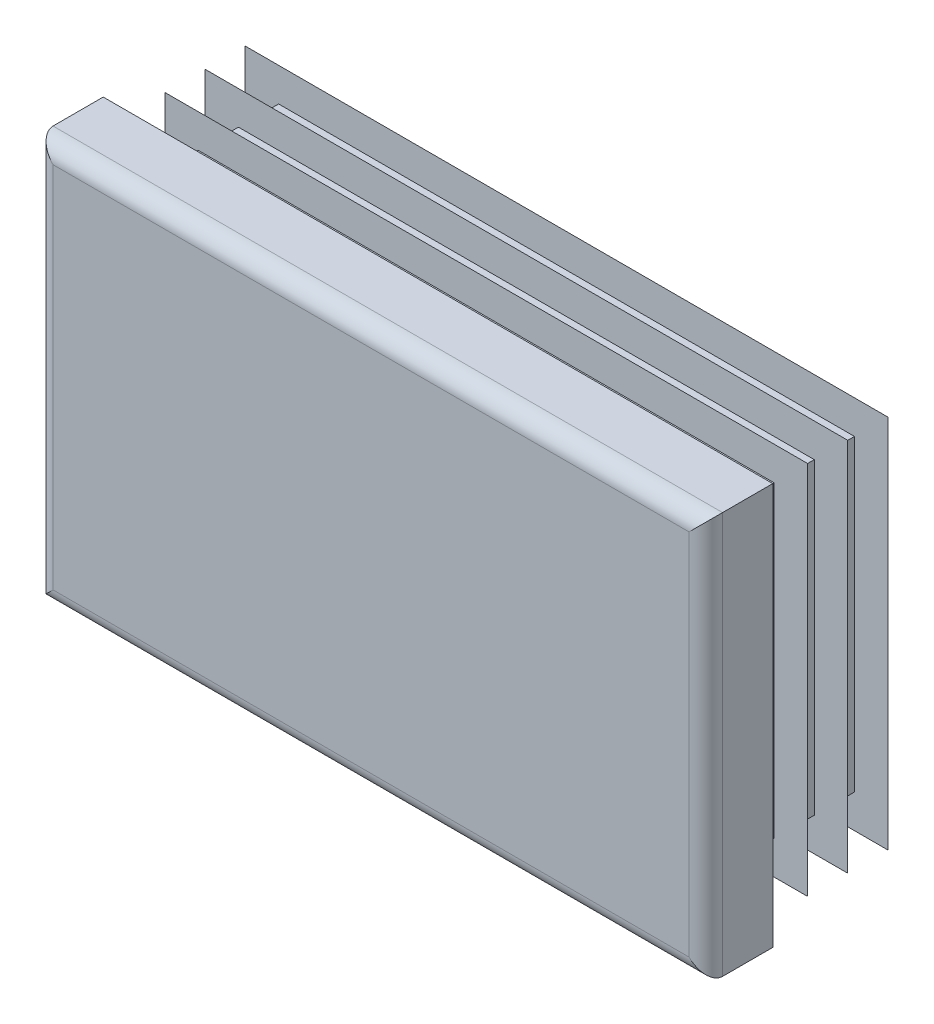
ISO-10303-21;
HEADER;
FILE_DESCRIPTION(('STEP AP214'),'2;1');
FILE_NAME('part.step','',(''),(''),'','','');
FILE_SCHEMA(('AUTOMOTIVE_DESIGN { 1 0 10303 214 1 1 1 1 }'));
ENDSEC;
DATA;
#1=APPLICATION_CONTEXT('core data for automotive mechanical design processes');
#2=APPLICATION_PROTOCOL_DEFINITION('international standard','automotive_design',2000,#1);
#3=PRODUCT_CONTEXT('',#1,'mechanical');
#4=PRODUCT('Part','Part','',(#3));
#5=PRODUCT_RELATED_PRODUCT_CATEGORY('part','',(#4));
#6=PRODUCT_DEFINITION_FORMATION('','',#4);
#7=PRODUCT_DEFINITION_CONTEXT('part definition',#1,'design');
#8=PRODUCT_DEFINITION('design','',#6,#7);
#9=PRODUCT_DEFINITION_SHAPE('','',#8);
#10=(LENGTH_UNIT() NAMED_UNIT(*) SI_UNIT(.MILLI.,.METRE.));
#11=(NAMED_UNIT(*) PLANE_ANGLE_UNIT() SI_UNIT($,.RADIAN.));
#12=(NAMED_UNIT(*) SI_UNIT($,.STERADIAN.) SOLID_ANGLE_UNIT());
#13=UNCERTAINTY_MEASURE_WITH_UNIT(LENGTH_MEASURE(1.E-05),#10,'distance_accuracy_value','');
#14=(GEOMETRIC_REPRESENTATION_CONTEXT(3) GLOBAL_UNCERTAINTY_ASSIGNED_CONTEXT((#13)) GLOBAL_UNIT_ASSIGNED_CONTEXT((#10,
#11,#12)) REPRESENTATION_CONTEXT('',''));
#15=CARTESIAN_POINT('',(0.,0.,0.));
#16=DIRECTION('',(0.,0.,1.));
#17=DIRECTION('',(1.,0.,0.));
#18=AXIS2_PLACEMENT_3D('',#15,#16,#17);
#19=CARTESIAN_POINT('',(23.75,-15.,5.));
#20=DIRECTION('',(0.,0.,-1.));
#21=DIRECTION('',(0.,1.,0.));
#22=AXIS2_PLACEMENT_3D('',#19,#20,#21);
#23=PLANE('',#22);
#24=DIRECTION('',(0.,1.,0.));
#25=VECTOR('',#24,1.);
#26=CARTESIAN_POINT('',(-23.75,-15.,5.));
#27=LINE('',#26,#25);
#28=CARTESIAN_POINT('',(-23.75,-13.75,5.));
#29=VERTEX_POINT('',#28);
#30=CARTESIAN_POINT('',(-23.75,13.75,5.));
#31=VERTEX_POINT('',#30);
#32=EDGE_CURVE('E310',#29,#31,#27,.T.);
#33=ORIENTED_EDGE('',*,*,#32,.F.);
#34=DIRECTION('',(-1.,0.,0.));
#35=VECTOR('',#34,1.);
#36=CARTESIAN_POINT('',(25.,-13.75,5.));
#37=LINE('',#36,#35);
#38=CARTESIAN_POINT('',(23.75,-13.75,5.));
#39=VERTEX_POINT('',#38);
#40=EDGE_CURVE('E482',#39,#29,#37,.T.);
#41=ORIENTED_EDGE('',*,*,#40,.F.);
#42=DIRECTION('',(0.,1.,0.));
#43=VECTOR('',#42,1.);
#44=CARTESIAN_POINT('',(23.75,-15.,5.));
#45=LINE('',#44,#43);
#46=CARTESIAN_POINT('',(23.75,13.75,5.));
#47=VERTEX_POINT('',#46);
#48=EDGE_CURVE('E305',#39,#47,#45,.T.);
#49=ORIENTED_EDGE('',*,*,#48,.T.);
#50=DIRECTION('',(-1.,0.,0.));
#51=VECTOR('',#50,1.);
#52=CARTESIAN_POINT('',(25.,13.75,5.));
#53=LINE('',#52,#51);
#54=EDGE_CURVE('E630',#47,#31,#53,.T.);
#55=ORIENTED_EDGE('',*,*,#54,.T.);
#56=EDGE_LOOP('',(#33,#41,#49,#55));
#57=FACE_BOUND('',#56,.T.);
#58=ADVANCED_FACE('F14',(#57),#23,.F.);
#59=CARTESIAN_POINT('',(-23.75,-15.,3.75));
#60=DIRECTION('',(0.,1.,0.));
#61=DIRECTION('',(-1.,0.,0.));
#62=AXIS2_PLACEMENT_3D('',#59,#60,#61);
#63=CYLINDRICAL_SURFACE('',#62,1.25);
#64=DIRECTION('',(0.,1.,0.));
#65=VECTOR('',#64,1.);
#66=CARTESIAN_POINT('',(-25.,-15.,3.75));
#67=LINE('',#66,#65);
#68=CARTESIAN_POINT('',(-25.,-15.,3.75));
#69=VERTEX_POINT('',#68);
#70=CARTESIAN_POINT('',(-25.,15.,3.75));
#71=VERTEX_POINT('',#70);
#72=EDGE_CURVE('E402',#69,#71,#67,.T.);
#73=ORIENTED_EDGE('',*,*,#72,.F.);
#74=CARTESIAN_POINT('',(-23.75,-13.75,3.75));
#75=DIRECTION('',(-0.707106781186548,0.707106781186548,0.));
#76=DIRECTION('',(0.707106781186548,0.707106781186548,0.));
#77=AXIS2_PLACEMENT_3D('',#74,#75,#76);
#78=ELLIPSE('',#77,1.76776695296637,1.25);
#79=EDGE_CURVE('E59',#69,#29,#78,.T.);
#80=ORIENTED_EDGE('',*,*,#79,.T.);
#81=ORIENTED_EDGE('',*,*,#32,.T.);
#82=CARTESIAN_POINT('',(-23.75,13.75,3.75));
#83=DIRECTION('',(0.707106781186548,0.707106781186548,0.));
#84=DIRECTION('',(-0.707106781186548,0.707106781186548,0.));
#85=AXIS2_PLACEMENT_3D('',#82,#83,#84);
#86=ELLIPSE('',#85,1.76776695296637,1.25);
#87=EDGE_CURVE('E306',#31,#71,#86,.F.);
#88=ORIENTED_EDGE('',*,*,#87,.T.);
#89=EDGE_LOOP('',(#73,#80,#81,#88));
#90=FACE_BOUND('',#89,.T.);
#91=ADVANCED_FACE('F16',(#90),#63,.T.);
#92=CARTESIAN_POINT('',(-25.,-15.,3.75));
#93=DIRECTION('',(1.,0.,0.));
#94=DIRECTION('',(0.,1.,0.));
#95=AXIS2_PLACEMENT_3D('',#92,#93,#94);
#96=PLANE('',#95);
#97=DIRECTION('',(0.,0.,-1.));
#98=VECTOR('',#97,1.);
#99=CARTESIAN_POINT('',(-25.,15.,3.75));
#100=LINE('',#99,#98);
#101=CARTESIAN_POINT('',(-25.,15.,0.));
#102=VERTEX_POINT('',#101);
#103=EDGE_CURVE('E615',#71,#102,#100,.T.);
#104=ORIENTED_EDGE('',*,*,#103,.T.);
#105=DIRECTION('',(0.,1.,0.));
#106=VECTOR('',#105,1.);
#107=CARTESIAN_POINT('',(-25.,-15.,0.));
#108=LINE('',#107,#106);
#109=CARTESIAN_POINT('',(-25.,-15.,0.));
#110=VERTEX_POINT('',#109);
#111=EDGE_CURVE('E400',#110,#102,#108,.T.);
#112=ORIENTED_EDGE('',*,*,#111,.F.);
#113=DIRECTION('',(0.,0.,-1.));
#114=VECTOR('',#113,1.);
#115=CARTESIAN_POINT('',(-25.,-15.,3.75));
#116=LINE('',#115,#114);
#117=EDGE_CURVE('E616',#69,#110,#116,.T.);
#118=ORIENTED_EDGE('',*,*,#117,.F.);
#119=ORIENTED_EDGE('',*,*,#72,.T.);
#120=EDGE_LOOP('',(#104,#112,#118,#119));
#121=FACE_BOUND('',#120,.T.);
#122=ADVANCED_FACE('F697',(#121),#96,.F.);
#123=CARTESIAN_POINT('',(-21.5,-15.,0.));
#124=DIRECTION('',(1.,0.,0.));
#125=DIRECTION('',(0.,1.,0.));
#126=AXIS2_PLACEMENT_3D('',#123,#124,#125);
#127=PLANE('',#126);
#128=DIRECTION('',(0.,1.,0.));
#129=VECTOR('',#128,1.);
#130=CARTESIAN_POINT('',(-21.5,-15.,0.));
#131=LINE('',#130,#129);
#132=CARTESIAN_POINT('',(-21.5,-11.5,0.));
#133=VERTEX_POINT('',#132);
#134=CARTESIAN_POINT('',(-21.5,11.5,0.));
#135=VERTEX_POINT('',#134);
#136=EDGE_CURVE('E397',#133,#135,#131,.T.);
#137=ORIENTED_EDGE('',*,*,#136,.T.);
#138=DIRECTION('',(0.,0.,-1.));
#139=VECTOR('',#138,1.);
#140=CARTESIAN_POINT('',(-21.5,11.5,0.));
#141=LINE('',#140,#139);
#142=CARTESIAN_POINT('',(-21.5,11.5,-0.6));
#143=VERTEX_POINT('',#142);
#144=EDGE_CURVE('E495',#135,#143,#141,.T.);
#145=ORIENTED_EDGE('',*,*,#144,.T.);
#146=DIRECTION('',(0.,1.,0.));
#147=VECTOR('',#146,1.);
#148=CARTESIAN_POINT('',(-21.5,-15.,-0.6));
#149=LINE('',#148,#147);
#150=CARTESIAN_POINT('',(-21.5,-11.5,-0.6));
#151=VERTEX_POINT('',#150);
#152=EDGE_CURVE('E394',#151,#143,#149,.T.);
#153=ORIENTED_EDGE('',*,*,#152,.F.);
#154=DIRECTION('',(0.,0.,1.));
#155=VECTOR('',#154,1.);
#156=CARTESIAN_POINT('',(-21.5,-11.5,0.));
#157=LINE('',#156,#155);
#158=EDGE_CURVE('E489',#151,#133,#157,.T.);
#159=ORIENTED_EDGE('',*,*,#158,.T.);
#160=EDGE_LOOP('',(#137,#145,#153,#159));
#161=FACE_BOUND('',#160,.T.);
#162=ADVANCED_FACE('F787',(#161),#127,.F.);
#163=CARTESIAN_POINT('',(-24.,-15.,-0.6));
#164=DIRECTION('',(0.342020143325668,0.,0.939692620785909));
#165=DIRECTION('',(-0.939692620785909,0.,0.342020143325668));
#166=AXIS2_PLACEMENT_3D('',#163,#164,#165);
#167=PLANE('',#166);
#168=DIRECTION('',(0.,1.,0.));
#169=VECTOR('',#168,1.);
#170=CARTESIAN_POINT('',(-24.,-15.,-0.6));
#171=LINE('',#170,#169);
#172=CARTESIAN_POINT('',(-24.,-14.,-0.6));
#173=VERTEX_POINT('',#172);
#174=CARTESIAN_POINT('',(-24.,14.,-0.6));
#175=VERTEX_POINT('',#174);
#176=EDGE_CURVE('E392',#173,#175,#171,.T.);
#177=ORIENTED_EDGE('',*,*,#176,.T.);
#178=DIRECTION('',(0.844349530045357,-0.43889572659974,-0.307318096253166));
#179=VECTOR('',#178,1.);
#180=CARTESIAN_POINT('',(-13.2531393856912,8.41374569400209,-4.51153737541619));
#181=LINE('',#180,#179);
#182=CARTESIAN_POINT('',(-21.5,12.7004915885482,-1.5099255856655));
#183=VERTEX_POINT('',#182);
#184=EDGE_CURVE('E519',#175,#183,#181,.T.);
#185=ORIENTED_EDGE('',*,*,#184,.T.);
#186=DIRECTION('',(0.,1.,0.));
#187=VECTOR('',#186,1.);
#188=CARTESIAN_POINT('',(-21.5,-15.,-1.5099255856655));
#189=LINE('',#188,#187);
#190=CARTESIAN_POINT('',(-21.5,-12.7004915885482,-1.5099255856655));
#191=VERTEX_POINT('',#190);
#192=EDGE_CURVE('E389',#191,#183,#189,.T.);
#193=ORIENTED_EDGE('',*,*,#192,.F.);
#194=DIRECTION('',(-0.844349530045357,-0.43889572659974,0.307318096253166));
#195=VECTOR('',#194,1.);
#196=CARTESIAN_POINT('',(-24.3705814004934,-14.1926294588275,-0.465119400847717));
#197=LINE('',#196,#195);
#198=EDGE_CURVE('E507',#191,#173,#197,.T.);
#199=ORIENTED_EDGE('',*,*,#198,.T.);
#200=EDGE_LOOP('',(#177,#185,#193,#199));
#201=FACE_BOUND('',#200,.T.);
#202=ADVANCED_FACE('F783',(#201),#167,.F.);
#203=CARTESIAN_POINT('',(-21.5,-15.,-1.5099255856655));
#204=DIRECTION('',(1.,0.,0.));
#205=DIRECTION('',(0.,1.,0.));
#206=AXIS2_PLACEMENT_3D('',#203,#204,#205);
#207=PLANE('',#206);
#208=ORIENTED_EDGE('',*,*,#192,.T.);
#209=DIRECTION('',(0.,-0.819152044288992,-0.573576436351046));
#210=VECTOR('',#209,1.);
#211=CARTESIAN_POINT('',(-21.5,-5.88681725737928,-14.5248993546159));
#212=LINE('',#211,#210);
#213=CARTESIAN_POINT('',(-21.5,11.5,-2.35051884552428));
#214=VERTEX_POINT('',#213);
#215=EDGE_CURVE('E516',#183,#214,#212,.T.);
#216=ORIENTED_EDGE('',*,*,#215,.T.);
#217=DIRECTION('',(0.,0.,-1.));
#218=VECTOR('',#217,1.);
#219=CARTESIAN_POINT('',(-21.5,11.5,-1.5099255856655));
#220=LINE('',#219,#218);
#221=CARTESIAN_POINT('',(-21.5,11.5,-3.6));
#222=VERTEX_POINT('',#221);
#223=EDGE_CURVE('E525',#214,#222,#220,.T.);
#224=ORIENTED_EDGE('',*,*,#223,.T.);
#225=DIRECTION('',(0.,1.,0.));
#226=VECTOR('',#225,1.);
#227=CARTESIAN_POINT('',(-21.5,-15.,-3.6));
#228=LINE('',#227,#226);
#229=CARTESIAN_POINT('',(-21.5,-11.5,-3.6));
#230=VERTEX_POINT('',#229);
#231=EDGE_CURVE('E386',#230,#222,#228,.T.);
#232=ORIENTED_EDGE('',*,*,#231,.F.);
#233=DIRECTION('',(0.,0.,1.));
#234=VECTOR('',#233,1.);
#235=CARTESIAN_POINT('',(-21.5,-11.5,-1.5099255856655));
#236=LINE('',#235,#234);
#237=CARTESIAN_POINT('',(-21.5,-11.5,-2.35051884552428));
#238=VERTEX_POINT('',#237);
#239=EDGE_CURVE('E522',#230,#238,#236,.T.);
#240=ORIENTED_EDGE('',*,*,#239,.T.);
#241=DIRECTION('',(0.,-0.819152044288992,0.573576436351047));
#242=VECTOR('',#241,1.);
#243=CARTESIAN_POINT('',(-21.5,-14.2434848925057,-0.429510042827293));
#244=LINE('',#243,#242);
#245=EDGE_CURVE('E504',#238,#191,#244,.T.);
#246=ORIENTED_EDGE('',*,*,#245,.T.);
#247=EDGE_LOOP('',(#208,#216,#224,#232,#240,#246));
#248=FACE_BOUND('',#247,.T.);
#249=ADVANCED_FACE('F779',(#248),#207,.F.);
#250=CARTESIAN_POINT('',(-24.,-15.,-3.6));
#251=DIRECTION('',(0.34202014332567,0.,0.939692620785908));
#252=DIRECTION('',(-0.939692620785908,0.,0.34202014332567));
#253=AXIS2_PLACEMENT_3D('',#250,#251,#252);
#254=PLANE('',#253);
#255=DIRECTION('',(0.,1.,0.));
#256=VECTOR('',#255,1.);
#257=CARTESIAN_POINT('',(-24.,-15.,-3.6));
#258=LINE('',#257,#256);
#259=CARTESIAN_POINT('',(-24.,-14.,-3.6));
#260=VERTEX_POINT('',#259);
#261=CARTESIAN_POINT('',(-24.,14.,-3.6));
#262=VERTEX_POINT('',#261);
#263=EDGE_CURVE('E384',#260,#262,#258,.T.);
#264=ORIENTED_EDGE('',*,*,#263,.T.);
#265=DIRECTION('',(0.844349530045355,-0.438895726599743,-0.307318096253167));
#266=VECTOR('',#265,1.);
#267=CARTESIAN_POINT('',(-13.2531393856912,8.41374569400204,-7.51153737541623));
#268=LINE('',#267,#266);
#269=CARTESIAN_POINT('',(-21.5,12.7004915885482,-4.50992558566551));
#270=VERTEX_POINT('',#269);
#271=EDGE_CURVE('E549',#262,#270,#268,.T.);
#272=ORIENTED_EDGE('',*,*,#271,.T.);
#273=DIRECTION('',(0.,1.,0.));
#274=VECTOR('',#273,1.);
#275=CARTESIAN_POINT('',(-21.5,-15.,-4.50992558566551));
#276=LINE('',#275,#274);
#277=CARTESIAN_POINT('',(-21.5,-12.7004915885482,-4.50992558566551));
#278=VERTEX_POINT('',#277);
#279=EDGE_CURVE('E381',#278,#270,#276,.T.);
#280=ORIENTED_EDGE('',*,*,#279,.F.);
#281=DIRECTION('',(-0.844349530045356,-0.438895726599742,0.307318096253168));
#282=VECTOR('',#281,1.);
#283=CARTESIAN_POINT('',(-24.3705814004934,-14.1926294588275,-3.46511940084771));
#284=LINE('',#283,#282);
#285=EDGE_CURVE('E537',#278,#260,#284,.T.);
#286=ORIENTED_EDGE('',*,*,#285,.T.);
#287=EDGE_LOOP('',(#264,#272,#280,#286));
#288=FACE_BOUND('',#287,.T.);
#289=ADVANCED_FACE('F775',(#288),#254,.F.);
#290=CARTESIAN_POINT('',(-21.5,-15.,-4.50992558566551));
#291=DIRECTION('',(1.,0.,0.));
#292=DIRECTION('',(0.,1.,0.));
#293=AXIS2_PLACEMENT_3D('',#290,#291,#292);
#294=PLANE('',#293);
#295=ORIENTED_EDGE('',*,*,#279,.T.);
#296=DIRECTION('',(0.,-0.819152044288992,-0.573576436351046));
#297=VECTOR('',#296,1.);
#298=CARTESIAN_POINT('',(-21.5,-5.88681725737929,-17.5248993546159));
#299=LINE('',#298,#297);
#300=CARTESIAN_POINT('',(-21.5,11.5,-5.35051884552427));
#301=VERTEX_POINT('',#300);
#302=EDGE_CURVE('E546',#270,#301,#299,.T.);
#303=ORIENTED_EDGE('',*,*,#302,.T.);
#304=DIRECTION('',(0.,0.,-1.));
#305=VECTOR('',#304,1.);
#306=CARTESIAN_POINT('',(-21.5,11.5,-4.50992558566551));
#307=LINE('',#306,#305);
#308=CARTESIAN_POINT('',(-21.5,11.5,-6.6));
#309=VERTEX_POINT('',#308);
#310=EDGE_CURVE('E555',#301,#309,#307,.T.);
#311=ORIENTED_EDGE('',*,*,#310,.T.);
#312=DIRECTION('',(0.,1.,0.));
#313=VECTOR('',#312,1.);
#314=CARTESIAN_POINT('',(-21.5,-15.,-6.6));
#315=LINE('',#314,#313);
#316=CARTESIAN_POINT('',(-21.5,-11.5,-6.6));
#317=VERTEX_POINT('',#316);
#318=EDGE_CURVE('E378',#317,#309,#315,.T.);
#319=ORIENTED_EDGE('',*,*,#318,.F.);
#320=DIRECTION('',(0.,0.,1.));
#321=VECTOR('',#320,1.);
#322=CARTESIAN_POINT('',(-21.5,-11.5,-4.50992558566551));
#323=LINE('',#322,#321);
#324=CARTESIAN_POINT('',(-21.5,-11.5,-5.35051884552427));
#325=VERTEX_POINT('',#324);
#326=EDGE_CURVE('E552',#317,#325,#323,.T.);
#327=ORIENTED_EDGE('',*,*,#326,.T.);
#328=DIRECTION('',(0.,-0.819152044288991,0.573576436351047));
#329=VECTOR('',#328,1.);
#330=CARTESIAN_POINT('',(-21.5,-14.2434848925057,-3.42951004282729));
#331=LINE('',#330,#329);
#332=EDGE_CURVE('E534',#325,#278,#331,.T.);
#333=ORIENTED_EDGE('',*,*,#332,.T.);
#334=EDGE_LOOP('',(#295,#303,#311,#319,#327,#333));
#335=FACE_BOUND('',#334,.T.);
#336=ADVANCED_FACE('F771',(#335),#294,.F.);
#337=CARTESIAN_POINT('',(-24.,-15.,-6.6));
#338=DIRECTION('',(0.34202014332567,0.,0.939692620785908));
#339=DIRECTION('',(-0.939692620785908,0.,0.34202014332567));
#340=AXIS2_PLACEMENT_3D('',#337,#338,#339);
#341=PLANE('',#340);
#342=DIRECTION('',(0.,1.,0.));
#343=VECTOR('',#342,1.);
#344=CARTESIAN_POINT('',(-24.,-15.,-6.6));
#345=LINE('',#344,#343);
#346=CARTESIAN_POINT('',(-24.,-14.,-6.6));
#347=VERTEX_POINT('',#346);
#348=CARTESIAN_POINT('',(-24.,14.,-6.6));
#349=VERTEX_POINT('',#348);
#350=EDGE_CURVE('E376',#347,#349,#345,.T.);
#351=ORIENTED_EDGE('',*,*,#350,.T.);
#352=DIRECTION('',(0.844349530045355,-0.438895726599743,-0.307318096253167));
#353=VECTOR('',#352,1.);
#354=CARTESIAN_POINT('',(-13.2531393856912,8.41374569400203,-10.5115373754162));
#355=LINE('',#354,#353);
#356=CARTESIAN_POINT('',(-21.5,12.7004915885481,-7.50992558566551));
#357=VERTEX_POINT('',#356);
#358=EDGE_CURVE('E579',#349,#357,#355,.T.);
#359=ORIENTED_EDGE('',*,*,#358,.T.);
#360=DIRECTION('',(0.,1.,0.));
#361=VECTOR('',#360,1.);
#362=CARTESIAN_POINT('',(-21.5,-15.,-7.50992558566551));
#363=LINE('',#362,#361);
#364=CARTESIAN_POINT('',(-21.5,-12.7004915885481,-7.50992558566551));
#365=VERTEX_POINT('',#364);
#366=EDGE_CURVE('E373',#365,#357,#363,.T.);
#367=ORIENTED_EDGE('',*,*,#366,.F.);
#368=DIRECTION('',(-0.844349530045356,-0.438895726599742,0.307318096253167));
#369=VECTOR('',#368,1.);
#370=CARTESIAN_POINT('',(-24.3705814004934,-14.1926294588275,-6.46511940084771));
#371=LINE('',#370,#369);
#372=EDGE_CURVE('E567',#365,#347,#371,.T.);
#373=ORIENTED_EDGE('',*,*,#372,.T.);
#374=EDGE_LOOP('',(#351,#359,#367,#373));
#375=FACE_BOUND('',#374,.T.);
#376=ADVANCED_FACE('F767',(#375),#341,.F.);
#377=CARTESIAN_POINT('',(-21.5,-15.,-7.50992558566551));
#378=DIRECTION('',(1.,0.,0.));
#379=DIRECTION('',(0.,1.,0.));
#380=AXIS2_PLACEMENT_3D('',#377,#378,#379);
#381=PLANE('',#380);
#382=ORIENTED_EDGE('',*,*,#366,.T.);
#383=DIRECTION('',(0.,-0.819152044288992,-0.573576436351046));
#384=VECTOR('',#383,1.);
#385=CARTESIAN_POINT('',(-21.5,-5.8868172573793,-20.5248993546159));
#386=LINE('',#385,#384);
#387=CARTESIAN_POINT('',(-21.5,11.5,-8.35051884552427));
#388=VERTEX_POINT('',#387);
#389=EDGE_CURVE('E576',#357,#388,#386,.T.);
#390=ORIENTED_EDGE('',*,*,#389,.T.);
#391=DIRECTION('',(0.,0.,-1.));
#392=VECTOR('',#391,1.);
#393=CARTESIAN_POINT('',(-21.5,11.5,-7.50992558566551));
#394=LINE('',#393,#392);
#395=CARTESIAN_POINT('',(-21.5,11.5,-9.6));
#396=VERTEX_POINT('',#395);
#397=EDGE_CURVE('E585',#388,#396,#394,.T.);
#398=ORIENTED_EDGE('',*,*,#397,.T.);
#399=DIRECTION('',(0.,1.,0.));
#400=VECTOR('',#399,1.);
#401=CARTESIAN_POINT('',(-21.5,-15.,-9.6));
#402=LINE('',#401,#400);
#403=CARTESIAN_POINT('',(-21.5,-11.5,-9.6));
#404=VERTEX_POINT('',#403);
#405=EDGE_CURVE('E370',#404,#396,#402,.T.);
#406=ORIENTED_EDGE('',*,*,#405,.F.);
#407=DIRECTION('',(0.,0.,1.));
#408=VECTOR('',#407,1.);
#409=CARTESIAN_POINT('',(-21.5,-11.5,-7.50992558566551));
#410=LINE('',#409,#408);
#411=CARTESIAN_POINT('',(-21.5,-11.5,-8.35051884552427));
#412=VERTEX_POINT('',#411);
#413=EDGE_CURVE('E582',#404,#412,#410,.T.);
#414=ORIENTED_EDGE('',*,*,#413,.T.);
#415=DIRECTION('',(0.,-0.819152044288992,0.573576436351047));
#416=VECTOR('',#415,1.);
#417=CARTESIAN_POINT('',(-21.5,-14.2434848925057,-6.42951004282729));
#418=LINE('',#417,#416);
#419=EDGE_CURVE('E564',#412,#365,#418,.T.);
#420=ORIENTED_EDGE('',*,*,#419,.T.);
#421=EDGE_LOOP('',(#382,#390,#398,#406,#414,#420));
#422=FACE_BOUND('',#421,.T.);
#423=ADVANCED_FACE('F764',(#422),#381,.F.);
#424=CARTESIAN_POINT('',(-24.,-15.,-9.6));
#425=DIRECTION('',(0.342020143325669,0.,0.939692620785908));
#426=DIRECTION('',(-0.939692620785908,0.,0.342020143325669));
#427=AXIS2_PLACEMENT_3D('',#424,#425,#426);
#428=PLANE('',#427);
#429=DIRECTION('',(0.,1.,0.));
#430=VECTOR('',#429,1.);
#431=CARTESIAN_POINT('',(-24.,-15.,-9.6));
#432=LINE('',#431,#430);
#433=CARTESIAN_POINT('',(-24.,-14.,-9.6));
#434=VERTEX_POINT('',#433);
#435=CARTESIAN_POINT('',(-24.,14.,-9.6));
#436=VERTEX_POINT('',#435);
#437=EDGE_CURVE('E368',#434,#436,#432,.T.);
#438=ORIENTED_EDGE('',*,*,#437,.T.);
#439=DIRECTION('',(0.844349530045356,-0.438895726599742,-0.307318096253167));
#440=VECTOR('',#439,1.);
#441=CARTESIAN_POINT('',(-13.2531393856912,8.41374569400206,-13.5115373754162));
#442=LINE('',#441,#440);
#443=CARTESIAN_POINT('',(-21.5,12.7004915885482,-10.5099255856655));
#444=VERTEX_POINT('',#443);
#445=EDGE_CURVE('E607',#436,#444,#442,.T.);
#446=ORIENTED_EDGE('',*,*,#445,.T.);
#447=DIRECTION('',(0.,1.,0.));
#448=VECTOR('',#447,1.);
#449=CARTESIAN_POINT('',(-21.5,-15.,-10.5099255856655));
#450=LINE('',#449,#448);
#451=CARTESIAN_POINT('',(-21.5,-12.7004915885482,-10.5099255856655));
#452=VERTEX_POINT('',#451);
#453=EDGE_CURVE('E365',#452,#444,#450,.T.);
#454=ORIENTED_EDGE('',*,*,#453,.F.);
#455=DIRECTION('',(-0.844349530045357,-0.438895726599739,0.307318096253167));
#456=VECTOR('',#455,1.);
#457=CARTESIAN_POINT('',(-24.3705814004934,-14.1926294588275,-9.46511940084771));
#458=LINE('',#457,#456);
#459=EDGE_CURVE('E595',#452,#434,#458,.T.);
#460=ORIENTED_EDGE('',*,*,#459,.T.);
#461=EDGE_LOOP('',(#438,#446,#454,#460));
#462=FACE_BOUND('',#461,.T.);
#463=ADVANCED_FACE('F675',(#462),#428,.F.);
#464=CARTESIAN_POINT('',(-21.5,-15.,-10.5099255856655));
#465=DIRECTION('',(1.,0.,0.));
#466=DIRECTION('',(0.,1.,0.));
#467=AXIS2_PLACEMENT_3D('',#464,#465,#466);
#468=PLANE('',#467);
#469=ORIENTED_EDGE('',*,*,#453,.T.);
#470=DIRECTION('',(0.,-0.819152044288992,-0.573576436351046));
#471=VECTOR('',#470,1.);
#472=CARTESIAN_POINT('',(-21.5,-5.88681725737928,-23.5248993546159));
#473=LINE('',#472,#471);
#474=CARTESIAN_POINT('',(-21.5,11.5,-11.3505188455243));
#475=VERTEX_POINT('',#474);
#476=EDGE_CURVE('E604',#444,#475,#473,.T.);
#477=ORIENTED_EDGE('',*,*,#476,.T.);
#478=DIRECTION('',(0.,0.,-1.));
#479=VECTOR('',#478,1.);
#480=CARTESIAN_POINT('',(-21.5,11.5,-10.5099255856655));
#481=LINE('',#480,#479);
#482=CARTESIAN_POINT('',(-21.5,11.5,-12.));
#483=VERTEX_POINT('',#482);
#484=EDGE_CURVE('E613',#475,#483,#481,.T.);
#485=ORIENTED_EDGE('',*,*,#484,.T.);
#486=DIRECTION('',(0.,1.,0.));
#487=VECTOR('',#486,1.);
#488=CARTESIAN_POINT('',(-21.5,-15.,-12.));
#489=LINE('',#488,#487);
#490=CARTESIAN_POINT('',(-21.5,-11.5,-12.));
#491=VERTEX_POINT('',#490);
#492=EDGE_CURVE('E362',#491,#483,#489,.T.);
#493=ORIENTED_EDGE('',*,*,#492,.F.);
#494=DIRECTION('',(0.,0.,1.));
#495=VECTOR('',#494,1.);
#496=CARTESIAN_POINT('',(-21.5,-11.5,-10.5099255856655));
#497=LINE('',#496,#495);
#498=CARTESIAN_POINT('',(-21.5,-11.5,-11.3505188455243));
#499=VERTEX_POINT('',#498);
#500=EDGE_CURVE('E610',#491,#499,#497,.T.);
#501=ORIENTED_EDGE('',*,*,#500,.T.);
#502=DIRECTION('',(0.,-0.81915204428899,0.573576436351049));
#503=VECTOR('',#502,1.);
#504=CARTESIAN_POINT('',(-21.5,-14.2434848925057,-9.42951004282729));
#505=LINE('',#504,#503);
#506=EDGE_CURVE('E592',#499,#452,#505,.T.);
#507=ORIENTED_EDGE('',*,*,#506,.T.);
#508=EDGE_LOOP('',(#469,#477,#485,#493,#501,#507));
#509=FACE_BOUND('',#508,.T.);
#510=ADVANCED_FACE('F677',(#509),#468,.F.);
#511=CARTESIAN_POINT('',(-21.5,-15.,-12.));
#512=DIRECTION('',(0.,0.,1.));
#513=DIRECTION('',(0.,-1.,0.));
#514=AXIS2_PLACEMENT_3D('',#511,#512,#513);
#515=PLANE('',#514);
#516=ORIENTED_EDGE('',*,*,#492,.T.);
#517=DIRECTION('',(-1.,0.,0.));
#518=VECTOR('',#517,1.);
#519=CARTESIAN_POINT('',(25.,11.5,-12.));
#520=LINE('',#519,#518);
#521=CARTESIAN_POINT('',(21.5,11.5,-12.));
#522=VERTEX_POINT('',#521);
#523=EDGE_CURVE('E438',#522,#483,#520,.T.);
#524=ORIENTED_EDGE('',*,*,#523,.F.);
#525=DIRECTION('',(0.,1.,0.));
#526=VECTOR('',#525,1.);
#527=CARTESIAN_POINT('',(21.5,-15.,-12.));
#528=LINE('',#527,#526);
#529=CARTESIAN_POINT('',(21.5,-11.5,-12.));
#530=VERTEX_POINT('',#529);
#531=EDGE_CURVE('E359',#530,#522,#528,.T.);
#532=ORIENTED_EDGE('',*,*,#531,.F.);
#533=DIRECTION('',(-1.,0.,0.));
#534=VECTOR('',#533,1.);
#535=CARTESIAN_POINT('',(25.,-11.5,-12.));
#536=LINE('',#535,#534);
#537=EDGE_CURVE('E436',#530,#491,#536,.T.);
#538=ORIENTED_EDGE('',*,*,#537,.T.);
#539=EDGE_LOOP('',(#516,#524,#532,#538));
#540=FACE_BOUND('',#539,.T.);
#541=ADVANCED_FACE('F435',(#540),#515,.F.);
#542=CARTESIAN_POINT('',(21.5,-15.,-12.));
#543=DIRECTION('',(-1.,0.,0.));
#544=DIRECTION('',(0.,-1.,0.));
#545=AXIS2_PLACEMENT_3D('',#542,#543,#544);
#546=PLANE('',#545);
#547=DIRECTION('',(0.,0.,1.));
#548=VECTOR('',#547,1.);
#549=CARTESIAN_POINT('',(21.5,11.5,-12.));
#550=LINE('',#549,#548);
#551=CARTESIAN_POINT('',(21.5,11.5,-11.3505188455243));
#552=VERTEX_POINT('',#551);
#553=EDGE_CURVE('E9',#522,#552,#550,.T.);
#554=ORIENTED_EDGE('',*,*,#553,.T.);
#555=DIRECTION('',(0.,0.819152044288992,0.573576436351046));
#556=VECTOR('',#555,1.);
#557=CARTESIAN_POINT('',(21.5,-6.58692322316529,-24.0151188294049));
#558=LINE('',#557,#556);
#559=CARTESIAN_POINT('',(21.5,12.7004915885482,-10.5099255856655));
#560=VERTEX_POINT('',#559);
#561=EDGE_CURVE('E601',#552,#560,#558,.T.);
#562=ORIENTED_EDGE('',*,*,#561,.T.);
#563=DIRECTION('',(0.,1.,0.));
#564=VECTOR('',#563,1.);
#565=CARTESIAN_POINT('',(21.5,-15.,-10.5099255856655));
#566=LINE('',#565,#564);
#567=CARTESIAN_POINT('',(21.5,-12.7004915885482,-10.5099255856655));
#568=VERTEX_POINT('',#567);
#569=EDGE_CURVE('E356',#568,#560,#566,.T.);
#570=ORIENTED_EDGE('',*,*,#569,.F.);
#571=DIRECTION('',(0.,0.81915204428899,-0.573576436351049));
#572=VECTOR('',#571,1.);
#573=CARTESIAN_POINT('',(21.5,-13.5433789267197,-9.91972951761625));
#574=LINE('',#573,#572);
#575=CARTESIAN_POINT('',(21.5,-11.5,-11.3505188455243));
#576=VERTEX_POINT('',#575);
#577=EDGE_CURVE('E428',#568,#576,#574,.T.);
#578=ORIENTED_EDGE('',*,*,#577,.T.);
#579=DIRECTION('',(0.,0.,-1.));
#580=VECTOR('',#579,1.);
#581=CARTESIAN_POINT('',(21.5,-11.5,-12.));
#582=LINE('',#581,#580);
#583=EDGE_CURVE('E23',#576,#530,#582,.T.);
#584=ORIENTED_EDGE('',*,*,#583,.T.);
#585=ORIENTED_EDGE('',*,*,#531,.T.);
#586=EDGE_LOOP('',(#554,#562,#570,#578,#584,#585));
#587=FACE_BOUND('',#586,.T.);
#588=ADVANCED_FACE('F426',(#587),#546,.F.);
#589=CARTESIAN_POINT('',(21.5,-15.,-10.5099255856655));
#590=DIRECTION('',(-0.342020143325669,0.,0.939692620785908));
#591=DIRECTION('',(-0.939692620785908,0.,-0.342020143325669));
#592=AXIS2_PLACEMENT_3D('',#589,#590,#591);
#593=PLANE('',#592);
#594=ORIENTED_EDGE('',*,*,#569,.T.);
#595=DIRECTION('',(0.844349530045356,0.438895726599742,0.307318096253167));
#596=VECTOR('',#595,1.);
#597=CARTESIAN_POINT('',(11.23471303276,7.36456088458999,-14.2461844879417));
#598=LINE('',#597,#596);
#599=CARTESIAN_POINT('',(24.,14.,-9.6));
#600=VERTEX_POINT('',#599);
#601=EDGE_CURVE('E598',#560,#600,#598,.T.);
#602=ORIENTED_EDGE('',*,*,#601,.T.);
#603=DIRECTION('',(0.,1.,0.));
#604=VECTOR('',#603,1.);
#605=CARTESIAN_POINT('',(24.,-15.,-9.6));
#606=LINE('',#605,#604);
#607=CARTESIAN_POINT('',(24.,-14.,-9.6));
#608=VERTEX_POINT('',#607);
#609=EDGE_CURVE('E353',#608,#600,#606,.T.);
#610=ORIENTED_EDGE('',*,*,#609,.F.);
#611=DIRECTION('',(-0.844349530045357,0.438895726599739,-0.307318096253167));
#612=VECTOR('',#611,1.);
#613=CARTESIAN_POINT('',(22.3521550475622,-13.1434446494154,-10.1997665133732));
#614=LINE('',#613,#612);
#615=EDGE_CURVE('E588',#608,#568,#614,.T.);
#616=ORIENTED_EDGE('',*,*,#615,.T.);
#617=EDGE_LOOP('',(#594,#602,#610,#616));
#618=FACE_BOUND('',#617,.T.);
#619=ADVANCED_FACE('F752',(#618),#593,.F.);
#620=CARTESIAN_POINT('',(24.,-15.,-9.6));
#621=DIRECTION('',(0.,0.,-1.));
#622=DIRECTION('',(0.,1.,0.));
#623=AXIS2_PLACEMENT_3D('',#620,#621,#622);
#624=PLANE('',#623);
#625=ORIENTED_EDGE('',*,*,#609,.T.);
#626=DIRECTION('',(-1.,0.,0.));
#627=VECTOR('',#626,1.);
#628=CARTESIAN_POINT('',(25.,14.,-9.6));
#629=LINE('',#628,#627);
#630=EDGE_CURVE('E444',#600,#436,#629,.T.);
#631=ORIENTED_EDGE('',*,*,#630,.T.);
#632=ORIENTED_EDGE('',*,*,#437,.F.);
#633=DIRECTION('',(-1.,0.,0.));
#634=VECTOR('',#633,1.);
#635=CARTESIAN_POINT('',(25.,-14.,-9.6));
#636=LINE('',#635,#634);
#637=EDGE_CURVE('E451',#608,#434,#636,.T.);
#638=ORIENTED_EDGE('',*,*,#637,.F.);
#639=EDGE_LOOP('',(#625,#631,#632,#638));
#640=FACE_BOUND('',#639,.T.);
#641=ORIENTED_EDGE('',*,*,#405,.T.);
#642=DIRECTION('',(-1.,0.,0.));
#643=VECTOR('',#642,1.);
#644=CARTESIAN_POINT('',(25.,11.5,-9.6));
#645=LINE('',#644,#643);
#646=CARTESIAN_POINT('',(21.5,11.5,-9.6));
#647=VERTEX_POINT('',#646);
#648=EDGE_CURVE('E663',#647,#396,#645,.T.);
#649=ORIENTED_EDGE('',*,*,#648,.F.);
#650=DIRECTION('',(0.,1.,0.));
#651=VECTOR('',#650,1.);
#652=CARTESIAN_POINT('',(21.5,-15.,-9.6));
#653=LINE('',#652,#651);
#654=CARTESIAN_POINT('',(21.5,-11.5,-9.6));
#655=VERTEX_POINT('',#654);
#656=EDGE_CURVE('E350',#655,#647,#653,.T.);
#657=ORIENTED_EDGE('',*,*,#656,.F.);
#658=DIRECTION('',(-1.,0.,0.));
#659=VECTOR('',#658,1.);
#660=CARTESIAN_POINT('',(25.,-11.5,-9.6));
#661=LINE('',#660,#659);
#662=EDGE_CURVE('E453',#655,#404,#661,.T.);
#663=ORIENTED_EDGE('',*,*,#662,.T.);
#664=EDGE_LOOP('',(#641,#649,#657,#663));
#665=FACE_BOUND('',#664,.T.);
#666=ADVANCED_FACE('F667',(#640,#665),#624,.F.);
#667=CARTESIAN_POINT('',(21.5,-15.,-9.6));
#668=DIRECTION('',(-1.,0.,0.));
#669=DIRECTION('',(0.,-1.,0.));
#670=AXIS2_PLACEMENT_3D('',#667,#668,#669);
#671=PLANE('',#670);
#672=DIRECTION('',(0.,0.,1.));
#673=VECTOR('',#672,1.);
#674=CARTESIAN_POINT('',(21.5,11.5,-9.6));
#675=LINE('',#674,#673);
#676=CARTESIAN_POINT('',(21.5,11.5,-8.35051884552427));
#677=VERTEX_POINT('',#676);
#678=EDGE_CURVE('E420',#647,#677,#675,.T.);
#679=ORIENTED_EDGE('',*,*,#678,.T.);
#680=DIRECTION('',(0.,0.819152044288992,0.573576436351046));
#681=VECTOR('',#680,1.);
#682=CARTESIAN_POINT('',(21.5,-6.86883100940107,-21.2125127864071));
#683=LINE('',#682,#681);
#684=CARTESIAN_POINT('',(21.5,12.7004915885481,-7.50992558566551));
#685=VERTEX_POINT('',#684);
#686=EDGE_CURVE('E573',#677,#685,#683,.T.);
#687=ORIENTED_EDGE('',*,*,#686,.T.);
#688=DIRECTION('',(0.,1.,0.));
#689=VECTOR('',#688,1.);
#690=CARTESIAN_POINT('',(21.5,-15.,-7.50992558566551));
#691=LINE('',#690,#689);
#692=CARTESIAN_POINT('',(21.5,-12.7004915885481,-7.50992558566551));
#693=VERTEX_POINT('',#692);
#694=EDGE_CURVE('E347',#693,#685,#691,.T.);
#695=ORIENTED_EDGE('',*,*,#694,.F.);
#696=DIRECTION('',(0.,0.819152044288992,-0.573576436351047));
#697=VECTOR('',#696,1.);
#698=CARTESIAN_POINT('',(21.5,-13.261471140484,-7.11712347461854));
#699=LINE('',#698,#697);
#700=CARTESIAN_POINT('',(21.5,-11.5,-8.35051884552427));
#701=VERTEX_POINT('',#700);
#702=EDGE_CURVE('E561',#693,#701,#699,.T.);
#703=ORIENTED_EDGE('',*,*,#702,.T.);
#704=DIRECTION('',(0.,0.,-1.));
#705=VECTOR('',#704,1.);
#706=CARTESIAN_POINT('',(21.5,-11.5,-9.6));
#707=LINE('',#706,#705);
#708=EDGE_CURVE('E417',#701,#655,#707,.T.);
#709=ORIENTED_EDGE('',*,*,#708,.T.);
#710=ORIENTED_EDGE('',*,*,#656,.T.);
#711=EDGE_LOOP('',(#679,#687,#695,#703,#709,#710));
#712=FACE_BOUND('',#711,.T.);
#713=ADVANCED_FACE('F745',(#712),#671,.F.);
#714=CARTESIAN_POINT('',(21.5,-15.,-7.50992558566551));
#715=DIRECTION('',(-0.342020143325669,0.,0.939692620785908));
#716=DIRECTION('',(-0.939692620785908,0.,-0.342020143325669));
#717=AXIS2_PLACEMENT_3D('',#714,#715,#716);
#718=PLANE('',#717);
#719=ORIENTED_EDGE('',*,*,#694,.T.);
#720=DIRECTION('',(0.844349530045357,0.438895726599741,0.307318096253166));
#721=VECTOR('',#720,1.);
#722=CARTESIAN_POINT('',(11.23471303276,7.36456088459,-11.2461844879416));
#723=LINE('',#722,#721);
#724=CARTESIAN_POINT('',(24.,14.,-6.6));
#725=VERTEX_POINT('',#724);
#726=EDGE_CURVE('E570',#685,#725,#723,.T.);
#727=ORIENTED_EDGE('',*,*,#726,.T.);
#728=DIRECTION('',(0.,1.,0.));
#729=VECTOR('',#728,1.);
#730=CARTESIAN_POINT('',(24.,-15.,-6.6));
#731=LINE('',#730,#729);
#732=CARTESIAN_POINT('',(24.,-14.,-6.6));
#733=VERTEX_POINT('',#732);
#734=EDGE_CURVE('E344',#733,#725,#731,.T.);
#735=ORIENTED_EDGE('',*,*,#734,.F.);
#736=DIRECTION('',(-0.844349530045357,0.43889572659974,-0.307318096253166));
#737=VECTOR('',#736,1.);
#738=CARTESIAN_POINT('',(22.3521550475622,-13.1434446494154,-7.19976651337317));
#739=LINE('',#738,#737);
#740=EDGE_CURVE('E558',#733,#693,#739,.T.);
#741=ORIENTED_EDGE('',*,*,#740,.T.);
#742=EDGE_LOOP('',(#719,#727,#735,#741));
#743=FACE_BOUND('',#742,.T.);
#744=ADVANCED_FACE('F741',(#743),#718,.F.);
#745=CARTESIAN_POINT('',(24.,-15.,-6.6));
#746=DIRECTION('',(0.,0.,-1.));
#747=DIRECTION('',(0.,1.,0.));
#748=AXIS2_PLACEMENT_3D('',#745,#746,#747);
#749=PLANE('',#748);
#750=ORIENTED_EDGE('',*,*,#734,.T.);
#751=DIRECTION('',(-1.,0.,0.));
#752=VECTOR('',#751,1.);
#753=CARTESIAN_POINT('',(25.,14.,-6.6));
#754=LINE('',#753,#752);
#755=EDGE_CURVE('E657',#725,#349,#754,.T.);
#756=ORIENTED_EDGE('',*,*,#755,.T.);
#757=ORIENTED_EDGE('',*,*,#350,.F.);
#758=DIRECTION('',(-1.,0.,0.));
#759=VECTOR('',#758,1.);
#760=CARTESIAN_POINT('',(25.,-14.,-6.6));
#761=LINE('',#760,#759);
#762=EDGE_CURVE('E459',#733,#347,#761,.T.);
#763=ORIENTED_EDGE('',*,*,#762,.F.);
#764=EDGE_LOOP('',(#750,#756,#757,#763));
#765=FACE_BOUND('',#764,.T.);
#766=ORIENTED_EDGE('',*,*,#318,.T.);
#767=DIRECTION('',(-1.,0.,0.));
#768=VECTOR('',#767,1.);
#769=CARTESIAN_POINT('',(25.,11.5,-6.6));
#770=LINE('',#769,#768);
#771=CARTESIAN_POINT('',(21.5,11.5,-6.6));
#772=VERTEX_POINT('',#771);
#773=EDGE_CURVE('E655',#772,#309,#770,.T.);
#774=ORIENTED_EDGE('',*,*,#773,.F.);
#775=DIRECTION('',(0.,1.,0.));
#776=VECTOR('',#775,1.);
#777=CARTESIAN_POINT('',(21.5,-15.,-6.6));
#778=LINE('',#777,#776);
#779=CARTESIAN_POINT('',(21.5,-11.5,-6.6));
#780=VERTEX_POINT('',#779);
#781=EDGE_CURVE('E341',#780,#772,#778,.T.);
#782=ORIENTED_EDGE('',*,*,#781,.F.);
#783=DIRECTION('',(-1.,0.,0.));
#784=VECTOR('',#783,1.);
#785=CARTESIAN_POINT('',(25.,-11.5,-6.6));
#786=LINE('',#785,#784);
#787=EDGE_CURVE('E461',#780,#317,#786,.T.);
#788=ORIENTED_EDGE('',*,*,#787,.T.);
#789=EDGE_LOOP('',(#766,#774,#782,#788));
#790=FACE_BOUND('',#789,.T.);
#791=ADVANCED_FACE('F737',(#765,#790),#749,.F.);
#792=CARTESIAN_POINT('',(21.5,-15.,-6.6));
#793=DIRECTION('',(-1.,0.,0.));
#794=DIRECTION('',(0.,-1.,0.));
#795=AXIS2_PLACEMENT_3D('',#792,#793,#794);
#796=PLANE('',#795);
#797=DIRECTION('',(0.,0.,1.));
#798=VECTOR('',#797,1.);
#799=CARTESIAN_POINT('',(21.5,11.5,-6.6));
#800=LINE('',#799,#798);
#801=CARTESIAN_POINT('',(21.5,11.5,-5.35051884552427));
#802=VERTEX_POINT('',#801);
#803=EDGE_CURVE('E414',#772,#802,#800,.T.);
#804=ORIENTED_EDGE('',*,*,#803,.T.);
#805=DIRECTION('',(0.,0.819152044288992,0.573576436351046));
#806=VECTOR('',#805,1.);
#807=CARTESIAN_POINT('',(21.5,-6.86883100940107,-18.2125127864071));
#808=LINE('',#807,#806);
#809=CARTESIAN_POINT('',(21.5,12.7004915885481,-4.50992558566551));
#810=VERTEX_POINT('',#809);
#811=EDGE_CURVE('E543',#802,#810,#808,.T.);
#812=ORIENTED_EDGE('',*,*,#811,.T.);
#813=DIRECTION('',(0.,1.,0.));
#814=VECTOR('',#813,1.);
#815=CARTESIAN_POINT('',(21.5,-15.,-4.50992558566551));
#816=LINE('',#815,#814);
#817=CARTESIAN_POINT('',(21.5,-12.7004915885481,-4.50992558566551));
#818=VERTEX_POINT('',#817);
#819=EDGE_CURVE('E338',#818,#810,#816,.T.);
#820=ORIENTED_EDGE('',*,*,#819,.F.);
#821=DIRECTION('',(0.,0.819152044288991,-0.573576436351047));
#822=VECTOR('',#821,1.);
#823=CARTESIAN_POINT('',(21.5,-13.261471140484,-4.11712347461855));
#824=LINE('',#823,#822);
#825=CARTESIAN_POINT('',(21.5,-11.5,-5.35051884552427));
#826=VERTEX_POINT('',#825);
#827=EDGE_CURVE('E531',#818,#826,#824,.T.);
#828=ORIENTED_EDGE('',*,*,#827,.T.);
#829=DIRECTION('',(0.,0.,-1.));
#830=VECTOR('',#829,1.);
#831=CARTESIAN_POINT('',(21.5,-11.5,-6.6));
#832=LINE('',#831,#830);
#833=EDGE_CURVE('E411',#826,#780,#832,.T.);
#834=ORIENTED_EDGE('',*,*,#833,.T.);
#835=ORIENTED_EDGE('',*,*,#781,.T.);
#836=EDGE_LOOP('',(#804,#812,#820,#828,#834,#835));
#837=FACE_BOUND('',#836,.T.);
#838=ADVANCED_FACE('F733',(#837),#796,.F.);
#839=CARTESIAN_POINT('',(21.5,-15.,-4.50992558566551));
#840=DIRECTION('',(-0.342020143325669,0.,0.939692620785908));
#841=DIRECTION('',(-0.939692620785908,0.,-0.342020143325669));
#842=AXIS2_PLACEMENT_3D('',#839,#840,#841);
#843=PLANE('',#842);
#844=ORIENTED_EDGE('',*,*,#819,.T.);
#845=DIRECTION('',(0.844349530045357,0.438895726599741,0.307318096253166));
#846=VECTOR('',#845,1.);
#847=CARTESIAN_POINT('',(11.23471303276,7.36456088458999,-8.24618448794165));
#848=LINE('',#847,#846);
#849=CARTESIAN_POINT('',(24.,14.,-3.6));
#850=VERTEX_POINT('',#849);
#851=EDGE_CURVE('E540',#810,#850,#848,.T.);
#852=ORIENTED_EDGE('',*,*,#851,.T.);
#853=DIRECTION('',(0.,1.,0.));
#854=VECTOR('',#853,1.);
#855=CARTESIAN_POINT('',(24.,-15.,-3.6));
#856=LINE('',#855,#854);
#857=CARTESIAN_POINT('',(24.,-14.,-3.6));
#858=VERTEX_POINT('',#857);
#859=EDGE_CURVE('E335',#858,#850,#856,.T.);
#860=ORIENTED_EDGE('',*,*,#859,.F.);
#861=DIRECTION('',(-0.844349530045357,0.43889572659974,-0.307318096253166));
#862=VECTOR('',#861,1.);
#863=CARTESIAN_POINT('',(22.3521550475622,-13.1434446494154,-4.19976651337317));
#864=LINE('',#863,#862);
#865=EDGE_CURVE('E528',#858,#818,#864,.T.);
#866=ORIENTED_EDGE('',*,*,#865,.T.);
#867=EDGE_LOOP('',(#844,#852,#860,#866));
#868=FACE_BOUND('',#867,.T.);
#869=ADVANCED_FACE('F729',(#868),#843,.F.);
#870=CARTESIAN_POINT('',(24.,-15.,-3.6));
#871=DIRECTION('',(0.,0.,-1.));
#872=DIRECTION('',(0.,1.,0.));
#873=AXIS2_PLACEMENT_3D('',#870,#871,#872);
#874=PLANE('',#873);
#875=ORIENTED_EDGE('',*,*,#859,.T.);
#876=DIRECTION('',(-1.,0.,0.));
#877=VECTOR('',#876,1.);
#878=CARTESIAN_POINT('',(25.,14.,-3.6));
#879=LINE('',#878,#877);
#880=EDGE_CURVE('E649',#850,#262,#879,.T.);
#881=ORIENTED_EDGE('',*,*,#880,.T.);
#882=ORIENTED_EDGE('',*,*,#263,.F.);
#883=DIRECTION('',(-1.,0.,0.));
#884=VECTOR('',#883,1.);
#885=CARTESIAN_POINT('',(25.,-14.,-3.6));
#886=LINE('',#885,#884);
#887=EDGE_CURVE('E467',#858,#260,#886,.T.);
#888=ORIENTED_EDGE('',*,*,#887,.F.);
#889=EDGE_LOOP('',(#875,#881,#882,#888));
#890=FACE_BOUND('',#889,.T.);
#891=ORIENTED_EDGE('',*,*,#231,.T.);
#892=DIRECTION('',(-1.,0.,0.));
#893=VECTOR('',#892,1.);
#894=CARTESIAN_POINT('',(25.,11.5,-3.6));
#895=LINE('',#894,#893);
#896=CARTESIAN_POINT('',(21.5,11.5,-3.6));
#897=VERTEX_POINT('',#896);
#898=EDGE_CURVE('E647',#897,#222,#895,.T.);
#899=ORIENTED_EDGE('',*,*,#898,.F.);
#900=DIRECTION('',(0.,1.,0.));
#901=VECTOR('',#900,1.);
#902=CARTESIAN_POINT('',(21.5,-15.,-3.6));
#903=LINE('',#902,#901);
#904=CARTESIAN_POINT('',(21.5,-11.5,-3.6));
#905=VERTEX_POINT('',#904);
#906=EDGE_CURVE('E332',#905,#897,#903,.T.);
#907=ORIENTED_EDGE('',*,*,#906,.F.);
#908=DIRECTION('',(-1.,0.,0.));
#909=VECTOR('',#908,1.);
#910=CARTESIAN_POINT('',(25.,-11.5,-3.6));
#911=LINE('',#910,#909);
#912=EDGE_CURVE('E469',#905,#230,#911,.T.);
#913=ORIENTED_EDGE('',*,*,#912,.T.);
#914=EDGE_LOOP('',(#891,#899,#907,#913));
#915=FACE_BOUND('',#914,.T.);
#916=ADVANCED_FACE('F725',(#890,#915),#874,.F.);
#917=CARTESIAN_POINT('',(21.5,-15.,-3.6));
#918=DIRECTION('',(-1.,0.,0.));
#919=DIRECTION('',(0.,-1.,0.));
#920=AXIS2_PLACEMENT_3D('',#917,#918,#919);
#921=PLANE('',#920);
#922=DIRECTION('',(0.,0.,1.));
#923=VECTOR('',#922,1.);
#924=CARTESIAN_POINT('',(21.5,11.5,-3.6));
#925=LINE('',#924,#923);
#926=CARTESIAN_POINT('',(21.5,11.5,-2.35051884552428));
#927=VERTEX_POINT('',#926);
#928=EDGE_CURVE('E408',#897,#927,#925,.T.);
#929=ORIENTED_EDGE('',*,*,#928,.T.);
#930=DIRECTION('',(0.,0.819152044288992,0.573576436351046));
#931=VECTOR('',#930,1.);
#932=CARTESIAN_POINT('',(21.5,-6.86883100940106,-15.2125127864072));
#933=LINE('',#932,#931);
#934=CARTESIAN_POINT('',(21.5,12.7004915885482,-1.5099255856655));
#935=VERTEX_POINT('',#934);
#936=EDGE_CURVE('E513',#927,#935,#933,.T.);
#937=ORIENTED_EDGE('',*,*,#936,.T.);
#938=DIRECTION('',(0.,1.,0.));
#939=VECTOR('',#938,1.);
#940=CARTESIAN_POINT('',(21.5,-15.,-1.5099255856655));
#941=LINE('',#940,#939);
#942=CARTESIAN_POINT('',(21.5,-12.7004915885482,-1.5099255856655));
#943=VERTEX_POINT('',#942);
#944=EDGE_CURVE('E329',#943,#935,#941,.T.);
#945=ORIENTED_EDGE('',*,*,#944,.F.);
#946=DIRECTION('',(0.,0.819152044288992,-0.573576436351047));
#947=VECTOR('',#946,1.);
#948=CARTESIAN_POINT('',(21.5,-13.261471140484,-1.11712347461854));
#949=LINE('',#948,#947);
#950=CARTESIAN_POINT('',(21.5,-11.5,-2.35051884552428));
#951=VERTEX_POINT('',#950);
#952=EDGE_CURVE('E501',#943,#951,#949,.T.);
#953=ORIENTED_EDGE('',*,*,#952,.T.);
#954=DIRECTION('',(0.,0.,-1.));
#955=VECTOR('',#954,1.);
#956=CARTESIAN_POINT('',(21.5,-11.5,-3.6));
#957=LINE('',#956,#955);
#958=EDGE_CURVE('E405',#951,#905,#957,.T.);
#959=ORIENTED_EDGE('',*,*,#958,.T.);
#960=ORIENTED_EDGE('',*,*,#906,.T.);
#961=EDGE_LOOP('',(#929,#937,#945,#953,#959,#960));
#962=FACE_BOUND('',#961,.T.);
#963=ADVANCED_FACE('F721',(#962),#921,.F.);
#964=CARTESIAN_POINT('',(21.5,-15.,-1.5099255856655));
#965=DIRECTION('',(-0.342020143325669,0.,0.939692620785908));
#966=DIRECTION('',(-0.939692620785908,0.,-0.342020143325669));
#967=AXIS2_PLACEMENT_3D('',#964,#965,#966);
#968=PLANE('',#967);
#969=ORIENTED_EDGE('',*,*,#944,.T.);
#970=DIRECTION('',(0.844349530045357,0.438895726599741,0.307318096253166));
#971=VECTOR('',#970,1.);
#972=CARTESIAN_POINT('',(11.23471303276,7.36456088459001,-5.24618448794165));
#973=LINE('',#972,#971);
#974=CARTESIAN_POINT('',(24.,14.,-0.6));
#975=VERTEX_POINT('',#974);
#976=EDGE_CURVE('E510',#935,#975,#973,.T.);
#977=ORIENTED_EDGE('',*,*,#976,.T.);
#978=DIRECTION('',(0.,1.,0.));
#979=VECTOR('',#978,1.);
#980=CARTESIAN_POINT('',(24.,-15.,-0.6));
#981=LINE('',#980,#979);
#982=CARTESIAN_POINT('',(24.,-14.,-0.6));
#983=VERTEX_POINT('',#982);
#984=EDGE_CURVE('E326',#983,#975,#981,.T.);
#985=ORIENTED_EDGE('',*,*,#984,.F.);
#986=DIRECTION('',(-0.844349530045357,0.43889572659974,-0.307318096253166));
#987=VECTOR('',#986,1.);
#988=CARTESIAN_POINT('',(22.3521550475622,-13.1434446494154,-1.19976651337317));
#989=LINE('',#988,#987);
#990=EDGE_CURVE('E498',#983,#943,#989,.T.);
#991=ORIENTED_EDGE('',*,*,#990,.T.);
#992=EDGE_LOOP('',(#969,#977,#985,#991));
#993=FACE_BOUND('',#992,.T.);
#994=ADVANCED_FACE('F717',(#993),#968,.F.);
#995=CARTESIAN_POINT('',(24.,-15.,-0.6));
#996=DIRECTION('',(0.,0.,-1.));
#997=DIRECTION('',(0.,1.,0.));
#998=AXIS2_PLACEMENT_3D('',#995,#996,#997);
#999=PLANE('',#998);
#1000=ORIENTED_EDGE('',*,*,#984,.T.);
#1001=DIRECTION('',(-1.,0.,0.));
#1002=VECTOR('',#1001,1.);
#1003=CARTESIAN_POINT('',(25.,14.,-0.6));
#1004=LINE('',#1003,#1002);
#1005=EDGE_CURVE('E641',#975,#175,#1004,.T.);
#1006=ORIENTED_EDGE('',*,*,#1005,.T.);
#1007=ORIENTED_EDGE('',*,*,#176,.F.);
#1008=DIRECTION('',(-1.,0.,0.));
#1009=VECTOR('',#1008,1.);
#1010=CARTESIAN_POINT('',(25.,-14.,-0.6));
#1011=LINE('',#1010,#1009);
#1012=EDGE_CURVE('E475',#983,#173,#1011,.T.);
#1013=ORIENTED_EDGE('',*,*,#1012,.F.);
#1014=EDGE_LOOP('',(#1000,#1006,#1007,#1013));
#1015=FACE_BOUND('',#1014,.T.);
#1016=ORIENTED_EDGE('',*,*,#152,.T.);
#1017=DIRECTION('',(-1.,0.,0.));
#1018=VECTOR('',#1017,1.);
#1019=CARTESIAN_POINT('',(25.,11.5,-0.6));
#1020=LINE('',#1019,#1018);
#1021=CARTESIAN_POINT('',(21.5,11.5,-0.6));
#1022=VERTEX_POINT('',#1021);
#1023=EDGE_CURVE('E639',#1022,#143,#1020,.T.);
#1024=ORIENTED_EDGE('',*,*,#1023,.F.);
#1025=DIRECTION('',(0.,1.,0.));
#1026=VECTOR('',#1025,1.);
#1027=CARTESIAN_POINT('',(21.5,-15.,-0.6));
#1028=LINE('',#1027,#1026);
#1029=CARTESIAN_POINT('',(21.5,-11.5,-0.6));
#1030=VERTEX_POINT('',#1029);
#1031=EDGE_CURVE('E323',#1030,#1022,#1028,.T.);
#1032=ORIENTED_EDGE('',*,*,#1031,.F.);
#1033=DIRECTION('',(-1.,0.,0.));
#1034=VECTOR('',#1033,1.);
#1035=CARTESIAN_POINT('',(25.,-11.5,-0.6));
#1036=LINE('',#1035,#1034);
#1037=EDGE_CURVE('E477',#1030,#151,#1036,.T.);
#1038=ORIENTED_EDGE('',*,*,#1037,.T.);
#1039=EDGE_LOOP('',(#1016,#1024,#1032,#1038));
#1040=FACE_BOUND('',#1039,.T.);
#1041=ADVANCED_FACE('F713',(#1015,#1040),#999,.F.);
#1042=CARTESIAN_POINT('',(21.5,-15.,-0.6));
#1043=DIRECTION('',(-1.,0.,0.));
#1044=DIRECTION('',(0.,-1.,0.));
#1045=AXIS2_PLACEMENT_3D('',#1042,#1043,#1044);
#1046=PLANE('',#1045);
#1047=ORIENTED_EDGE('',*,*,#1031,.T.);
#1048=DIRECTION('',(0.,0.,1.));
#1049=VECTOR('',#1048,1.);
#1050=CARTESIAN_POINT('',(21.5,11.5,-0.6));
#1051=LINE('',#1050,#1049);
#1052=CARTESIAN_POINT('',(21.5,11.5,0.));
#1053=VERTEX_POINT('',#1052);
#1054=EDGE_CURVE('E492',#1022,#1053,#1051,.T.);
#1055=ORIENTED_EDGE('',*,*,#1054,.T.);
#1056=DIRECTION('',(0.,1.,0.));
#1057=VECTOR('',#1056,1.);
#1058=CARTESIAN_POINT('',(21.5,-15.,0.));
#1059=LINE('',#1058,#1057);
#1060=CARTESIAN_POINT('',(21.5,-11.5,0.));
#1061=VERTEX_POINT('',#1060);
#1062=EDGE_CURVE('E316',#1061,#1053,#1059,.T.);
#1063=ORIENTED_EDGE('',*,*,#1062,.F.);
#1064=DIRECTION('',(0.,0.,-1.));
#1065=VECTOR('',#1064,1.);
#1066=CARTESIAN_POINT('',(21.5,-11.5,-0.6));
#1067=LINE('',#1066,#1065);
#1068=EDGE_CURVE('E486',#1061,#1030,#1067,.T.);
#1069=ORIENTED_EDGE('',*,*,#1068,.T.);
#1070=EDGE_LOOP('',(#1047,#1055,#1063,#1069));
#1071=FACE_BOUND('',#1070,.T.);
#1072=ADVANCED_FACE('F709',(#1071),#1046,.F.);
#1073=CARTESIAN_POINT('',(21.5,-15.,0.));
#1074=DIRECTION('',(0.,0.,1.));
#1075=DIRECTION('',(0.,-1.,0.));
#1076=AXIS2_PLACEMENT_3D('',#1073,#1074,#1075);
#1077=PLANE('',#1076);
#1078=DIRECTION('',(-1.,0.,0.));
#1079=VECTOR('',#1078,1.);
#1080=CARTESIAN_POINT('',(25.,11.5,0.));
#1081=LINE('',#1080,#1079);
#1082=EDGE_CURVE('E634',#1053,#135,#1081,.T.);
#1083=ORIENTED_EDGE('',*,*,#1082,.T.);
#1084=ORIENTED_EDGE('',*,*,#136,.F.);
#1085=DIRECTION('',(-1.,0.,0.));
#1086=VECTOR('',#1085,1.);
#1087=CARTESIAN_POINT('',(25.,-11.5,0.));
#1088=LINE('',#1087,#1086);
#1089=EDGE_CURVE('E296',#1061,#133,#1088,.T.);
#1090=ORIENTED_EDGE('',*,*,#1089,.F.);
#1091=ORIENTED_EDGE('',*,*,#1062,.T.);
#1092=EDGE_LOOP('',(#1083,#1084,#1090,#1091));
#1093=FACE_BOUND('',#1092,.T.);
#1094=ORIENTED_EDGE('',*,*,#111,.T.);
#1095=DIRECTION('',(1.,0.,0.));
#1096=VECTOR('',#1095,1.);
#1097=CARTESIAN_POINT('',(21.5,15.,0.));
#1098=LINE('',#1097,#1096);
#1099=CARTESIAN_POINT('',(25.,15.,0.));
#1100=VERTEX_POINT('',#1099);
#1101=EDGE_CURVE('E621',#102,#1100,#1098,.T.);
#1102=ORIENTED_EDGE('',*,*,#1101,.T.);
#1103=DIRECTION('',(0.,1.,0.));
#1104=VECTOR('',#1103,1.);
#1105=CARTESIAN_POINT('',(25.,-15.,0.));
#1106=LINE('',#1105,#1104);
#1107=CARTESIAN_POINT('',(25.,-15.,0.));
#1108=VERTEX_POINT('',#1107);
#1109=EDGE_CURVE('E45',#1108,#1100,#1106,.T.);
#1110=ORIENTED_EDGE('',*,*,#1109,.F.);
#1111=DIRECTION('',(1.,0.,0.));
#1112=VECTOR('',#1111,1.);
#1113=CARTESIAN_POINT('',(-25.,-15.,0.));
#1114=LINE('',#1113,#1112);
#1115=EDGE_CURVE('E31',#110,#1108,#1114,.T.);
#1116=ORIENTED_EDGE('',*,*,#1115,.F.);
#1117=EDGE_LOOP('',(#1094,#1102,#1110,#1116));
#1118=FACE_BOUND('',#1117,.T.);
#1119=ADVANCED_FACE('F706',(#1093,#1118),#1077,.F.);
#1120=CARTESIAN_POINT('',(25.,-15.,0.));
#1121=DIRECTION('',(-1.,0.,0.));
#1122=DIRECTION('',(0.,-1.,0.));
#1123=AXIS2_PLACEMENT_3D('',#1120,#1121,#1122);
#1124=PLANE('',#1123);
#1125=DIRECTION('',(0.,0.,1.));
#1126=VECTOR('',#1125,1.);
#1127=CARTESIAN_POINT('',(25.,15.,0.));
#1128=LINE('',#1127,#1126);
#1129=CARTESIAN_POINT('',(25.,15.,3.75));
#1130=VERTEX_POINT('',#1129);
#1131=EDGE_CURVE('E314',#1100,#1130,#1128,.T.);
#1132=ORIENTED_EDGE('',*,*,#1131,.T.);
#1133=DIRECTION('',(0.,1.,0.));
#1134=VECTOR('',#1133,1.);
#1135=CARTESIAN_POINT('',(25.,-15.,3.75));
#1136=LINE('',#1135,#1134);
#1137=CARTESIAN_POINT('',(25.,-15.,3.75));
#1138=VERTEX_POINT('',#1137);
#1139=EDGE_CURVE('E303',#1138,#1130,#1136,.T.);
#1140=ORIENTED_EDGE('',*,*,#1139,.F.);
#1141=DIRECTION('',(0.,0.,1.));
#1142=VECTOR('',#1141,1.);
#1143=CARTESIAN_POINT('',(25.,-15.,0.));
#1144=LINE('',#1143,#1142);
#1145=EDGE_CURVE('E308',#1108,#1138,#1144,.T.);
#1146=ORIENTED_EDGE('',*,*,#1145,.F.);
#1147=ORIENTED_EDGE('',*,*,#1109,.T.);
#1148=EDGE_LOOP('',(#1132,#1140,#1146,#1147));
#1149=FACE_BOUND('',#1148,.T.);
#1150=ADVANCED_FACE('F312',(#1149),#1124,.F.);
#1151=CARTESIAN_POINT('',(23.75,-15.,3.75));
#1152=DIRECTION('',(0.,1.,0.));
#1153=DIRECTION('',(-1.,0.,0.));
#1154=AXIS2_PLACEMENT_3D('',#1151,#1152,#1153);
#1155=CYLINDRICAL_SURFACE('',#1154,1.25);
#1156=ORIENTED_EDGE('',*,*,#48,.F.);
#1157=CARTESIAN_POINT('',(23.75,-13.75,3.75));
#1158=DIRECTION('',(0.707106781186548,0.707106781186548,0.));
#1159=DIRECTION('',(-0.707106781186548,0.707106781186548,0.));
#1160=AXIS2_PLACEMENT_3D('',#1157,#1158,#1159);
#1161=ELLIPSE('',#1160,1.76776695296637,1.25);
#1162=EDGE_CURVE('E293',#39,#1138,#1161,.T.);
#1163=ORIENTED_EDGE('',*,*,#1162,.T.);
#1164=ORIENTED_EDGE('',*,*,#1139,.T.);
#1165=CARTESIAN_POINT('',(23.75,13.75,3.75));
#1166=DIRECTION('',(-0.707106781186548,0.707106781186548,0.));
#1167=DIRECTION('',(0.707106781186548,0.707106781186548,0.));
#1168=AXIS2_PLACEMENT_3D('',#1165,#1166,#1167);
#1169=ELLIPSE('',#1168,1.76776695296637,1.25);
#1170=EDGE_CURVE('E52',#1130,#47,#1169,.F.);
#1171=ORIENTED_EDGE('',*,*,#1170,.T.);
#1172=EDGE_LOOP('',(#1156,#1163,#1164,#1171));
#1173=FACE_BOUND('',#1172,.T.);
#1174=ADVANCED_FACE('F301',(#1173),#1155,.T.);
#1175=CARTESIAN_POINT('',(-23.75,-15.,3.75));
#1176=DIRECTION('',(0.,-1.,0.));
#1177=DIRECTION('',(1.,0.,0.));
#1178=AXIS2_PLACEMENT_3D('',#1175,#1176,#1177);
#1179=PLANE('',#1178);
#1180=DIRECTION('',(-1.,0.,0.));
#1181=VECTOR('',#1180,1.);
#1182=CARTESIAN_POINT('',(25.,-15.,3.75));
#1183=LINE('',#1182,#1181);
#1184=EDGE_CURVE('E290',#1138,#69,#1183,.T.);
#1185=ORIENTED_EDGE('',*,*,#1184,.T.);
#1186=ORIENTED_EDGE('',*,*,#117,.T.);
#1187=ORIENTED_EDGE('',*,*,#1115,.T.);
#1188=ORIENTED_EDGE('',*,*,#1145,.T.);
#1189=EDGE_LOOP('',(#1185,#1186,#1187,#1188));
#1190=FACE_BOUND('',#1189,.T.);
#1191=ADVANCED_FACE('F309',(#1190),#1179,.T.);
#1192=CARTESIAN_POINT('',(-23.75,15.,3.75));
#1193=DIRECTION('',(0.,-1.,0.));
#1194=DIRECTION('',(1.,0.,0.));
#1195=AXIS2_PLACEMENT_3D('',#1192,#1193,#1194);
#1196=PLANE('',#1195);
#1197=ORIENTED_EDGE('',*,*,#103,.F.);
#1198=DIRECTION('',(-1.,0.,0.));
#1199=VECTOR('',#1198,1.);
#1200=CARTESIAN_POINT('',(25.,15.,3.75));
#1201=LINE('',#1200,#1199);
#1202=EDGE_CURVE('E631',#1130,#71,#1201,.T.);
#1203=ORIENTED_EDGE('',*,*,#1202,.F.);
#1204=ORIENTED_EDGE('',*,*,#1131,.F.);
#1205=ORIENTED_EDGE('',*,*,#1101,.F.);
#1206=EDGE_LOOP('',(#1197,#1203,#1204,#1205));
#1207=FACE_BOUND('',#1206,.T.);
#1208=ADVANCED_FACE('F700',(#1207),#1196,.F.);
#1209=CARTESIAN_POINT('',(25.,11.5,-0.6));
#1210=DIRECTION('',(0.,-1.,0.));
#1211=DIRECTION('',(1.,0.,0.));
#1212=AXIS2_PLACEMENT_3D('',#1209,#1210,#1211);
#1213=PLANE('',#1212);
#1214=ORIENTED_EDGE('',*,*,#1082,.F.);
#1215=ORIENTED_EDGE('',*,*,#1054,.F.);
#1216=ORIENTED_EDGE('',*,*,#1023,.T.);
#1217=ORIENTED_EDGE('',*,*,#144,.F.);
#1218=EDGE_LOOP('',(#1214,#1215,#1216,#1217));
#1219=FACE_BOUND('',#1218,.T.);
#1220=ADVANCED_FACE('F812',(#1219),#1213,.F.);
#1221=CARTESIAN_POINT('',(25.,11.5,-2.35051884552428));
#1222=DIRECTION('',(0.,-0.573576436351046,0.819152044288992));
#1223=DIRECTION('',(0.,-0.819152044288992,-0.573576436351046));
#1224=AXIS2_PLACEMENT_3D('',#1221,#1222,#1223);
#1225=PLANE('',#1224);
#1226=ORIENTED_EDGE('',*,*,#1005,.F.);
#1227=ORIENTED_EDGE('',*,*,#976,.F.);
#1228=ORIENTED_EDGE('',*,*,#936,.F.);
#1229=DIRECTION('',(-1.,0.,0.));
#1230=VECTOR('',#1229,1.);
#1231=CARTESIAN_POINT('',(25.,11.5,-2.35051884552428));
#1232=LINE('',#1231,#1230);
#1233=EDGE_CURVE('E644',#927,#214,#1232,.T.);
#1234=ORIENTED_EDGE('',*,*,#1233,.T.);
#1235=ORIENTED_EDGE('',*,*,#215,.F.);
#1236=ORIENTED_EDGE('',*,*,#184,.F.);
#1237=EDGE_LOOP('',(#1226,#1227,#1228,#1234,#1235,#1236));
#1238=FACE_BOUND('',#1237,.T.);
#1239=ADVANCED_FACE('F815',(#1238),#1225,.F.);
#1240=CARTESIAN_POINT('',(25.,11.5,-3.6));
#1241=DIRECTION('',(0.,-1.,0.));
#1242=DIRECTION('',(1.,0.,0.));
#1243=AXIS2_PLACEMENT_3D('',#1240,#1241,#1242);
#1244=PLANE('',#1243);
#1245=ORIENTED_EDGE('',*,*,#1233,.F.);
#1246=ORIENTED_EDGE('',*,*,#928,.F.);
#1247=ORIENTED_EDGE('',*,*,#898,.T.);
#1248=ORIENTED_EDGE('',*,*,#223,.F.);
#1249=EDGE_LOOP('',(#1245,#1246,#1247,#1248));
#1250=FACE_BOUND('',#1249,.T.);
#1251=ADVANCED_FACE('F819',(#1250),#1244,.F.);
#1252=CARTESIAN_POINT('',(25.,11.5,-5.35051884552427));
#1253=DIRECTION('',(0.,-0.573576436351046,0.819152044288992));
#1254=DIRECTION('',(0.,-0.819152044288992,-0.573576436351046));
#1255=AXIS2_PLACEMENT_3D('',#1252,#1253,#1254);
#1256=PLANE('',#1255);
#1257=ORIENTED_EDGE('',*,*,#880,.F.);
#1258=ORIENTED_EDGE('',*,*,#851,.F.);
#1259=ORIENTED_EDGE('',*,*,#811,.F.);
#1260=DIRECTION('',(-1.,0.,0.));
#1261=VECTOR('',#1260,1.);
#1262=CARTESIAN_POINT('',(25.,11.5,-5.35051884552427));
#1263=LINE('',#1262,#1261);
#1264=EDGE_CURVE('E652',#802,#301,#1263,.T.);
#1265=ORIENTED_EDGE('',*,*,#1264,.T.);
#1266=ORIENTED_EDGE('',*,*,#302,.F.);
#1267=ORIENTED_EDGE('',*,*,#271,.F.);
#1268=EDGE_LOOP('',(#1257,#1258,#1259,#1265,#1266,#1267));
#1269=FACE_BOUND('',#1268,.T.);
#1270=ADVANCED_FACE('F823',(#1269),#1256,.F.);
#1271=CARTESIAN_POINT('',(25.,11.5,-6.6));
#1272=DIRECTION('',(0.,-1.,0.));
#1273=DIRECTION('',(1.,0.,0.));
#1274=AXIS2_PLACEMENT_3D('',#1271,#1272,#1273);
#1275=PLANE('',#1274);
#1276=ORIENTED_EDGE('',*,*,#1264,.F.);
#1277=ORIENTED_EDGE('',*,*,#803,.F.);
#1278=ORIENTED_EDGE('',*,*,#773,.T.);
#1279=ORIENTED_EDGE('',*,*,#310,.F.);
#1280=EDGE_LOOP('',(#1276,#1277,#1278,#1279));
#1281=FACE_BOUND('',#1280,.T.);
#1282=ADVANCED_FACE('F827',(#1281),#1275,.F.);
#1283=CARTESIAN_POINT('',(25.,11.5,-8.35051884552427));
#1284=DIRECTION('',(0.,-0.573576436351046,0.819152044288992));
#1285=DIRECTION('',(0.,-0.819152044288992,-0.573576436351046));
#1286=AXIS2_PLACEMENT_3D('',#1283,#1284,#1285);
#1287=PLANE('',#1286);
#1288=ORIENTED_EDGE('',*,*,#755,.F.);
#1289=ORIENTED_EDGE('',*,*,#726,.F.);
#1290=ORIENTED_EDGE('',*,*,#686,.F.);
#1291=DIRECTION('',(-1.,0.,0.));
#1292=VECTOR('',#1291,1.);
#1293=CARTESIAN_POINT('',(25.,11.5,-8.35051884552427));
#1294=LINE('',#1293,#1292);
#1295=EDGE_CURVE('E660',#677,#388,#1294,.T.);
#1296=ORIENTED_EDGE('',*,*,#1295,.T.);
#1297=ORIENTED_EDGE('',*,*,#389,.F.);
#1298=ORIENTED_EDGE('',*,*,#358,.F.);
#1299=EDGE_LOOP('',(#1288,#1289,#1290,#1296,#1297,#1298));
#1300=FACE_BOUND('',#1299,.T.);
#1301=ADVANCED_FACE('F831',(#1300),#1287,.F.);
#1302=CARTESIAN_POINT('',(25.,11.5,-9.6));
#1303=DIRECTION('',(0.,-1.,0.));
#1304=DIRECTION('',(1.,0.,0.));
#1305=AXIS2_PLACEMENT_3D('',#1302,#1303,#1304);
#1306=PLANE('',#1305);
#1307=ORIENTED_EDGE('',*,*,#1295,.F.);
#1308=ORIENTED_EDGE('',*,*,#678,.F.);
#1309=ORIENTED_EDGE('',*,*,#648,.T.);
#1310=ORIENTED_EDGE('',*,*,#397,.F.);
#1311=EDGE_LOOP('',(#1307,#1308,#1309,#1310));
#1312=FACE_BOUND('',#1311,.T.);
#1313=ADVANCED_FACE('F835',(#1312),#1306,.F.);
#1314=CARTESIAN_POINT('',(25.,11.5,-11.3505188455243));
#1315=DIRECTION('',(0.,-0.573576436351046,0.819152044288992));
#1316=DIRECTION('',(0.,-0.819152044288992,-0.573576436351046));
#1317=AXIS2_PLACEMENT_3D('',#1314,#1315,#1316);
#1318=PLANE('',#1317);
#1319=ORIENTED_EDGE('',*,*,#630,.F.);
#1320=ORIENTED_EDGE('',*,*,#601,.F.);
#1321=ORIENTED_EDGE('',*,*,#561,.F.);
#1322=DIRECTION('',(-1.,0.,0.));
#1323=VECTOR('',#1322,1.);
#1324=CARTESIAN_POINT('',(25.,11.5,-11.3505188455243));
#1325=LINE('',#1324,#1323);
#1326=EDGE_CURVE('E441',#552,#475,#1325,.T.);
#1327=ORIENTED_EDGE('',*,*,#1326,.T.);
#1328=ORIENTED_EDGE('',*,*,#476,.F.);
#1329=ORIENTED_EDGE('',*,*,#445,.F.);
#1330=EDGE_LOOP('',(#1319,#1320,#1321,#1327,#1328,#1329));
#1331=FACE_BOUND('',#1330,.T.);
#1332=ADVANCED_FACE('F672',(#1331),#1318,.F.);
#1333=CARTESIAN_POINT('',(25.,11.5,-12.));
#1334=DIRECTION('',(0.,-1.,0.));
#1335=DIRECTION('',(1.,0.,0.));
#1336=AXIS2_PLACEMENT_3D('',#1333,#1334,#1335);
#1337=PLANE('',#1336);
#1338=ORIENTED_EDGE('',*,*,#1326,.F.);
#1339=ORIENTED_EDGE('',*,*,#553,.F.);
#1340=ORIENTED_EDGE('',*,*,#523,.T.);
#1341=ORIENTED_EDGE('',*,*,#484,.F.);
#1342=EDGE_LOOP('',(#1338,#1339,#1340,#1341));
#1343=FACE_BOUND('',#1342,.T.);
#1344=ADVANCED_FACE('F802',(#1343),#1337,.F.);
#1345=CARTESIAN_POINT('',(25.,13.75,3.75));
#1346=DIRECTION('',(-1.,0.,0.));
#1347=DIRECTION('',(0.,-1.,0.));
#1348=AXIS2_PLACEMENT_3D('',#1345,#1346,#1347);
#1349=CYLINDRICAL_SURFACE('',#1348,1.25);
#1350=ORIENTED_EDGE('',*,*,#54,.F.);
#1351=ORIENTED_EDGE('',*,*,#1170,.F.);
#1352=ORIENTED_EDGE('',*,*,#1202,.T.);
#1353=ORIENTED_EDGE('',*,*,#87,.F.);
#1354=EDGE_LOOP('',(#1350,#1351,#1352,#1353));
#1355=FACE_BOUND('',#1354,.T.);
#1356=ADVANCED_FACE('F799',(#1355),#1349,.T.);
#1357=CARTESIAN_POINT('',(25.,-11.5,0.));
#1358=DIRECTION('',(0.,1.,0.));
#1359=DIRECTION('',(-1.,0.,0.));
#1360=AXIS2_PLACEMENT_3D('',#1357,#1358,#1359);
#1361=PLANE('',#1360);
#1362=ORIENTED_EDGE('',*,*,#1037,.F.);
#1363=ORIENTED_EDGE('',*,*,#1068,.F.);
#1364=ORIENTED_EDGE('',*,*,#1089,.T.);
#1365=ORIENTED_EDGE('',*,*,#158,.F.);
#1366=EDGE_LOOP('',(#1362,#1363,#1364,#1365));
#1367=FACE_BOUND('',#1366,.T.);
#1368=ADVANCED_FACE('F801',(#1367),#1361,.F.);
#1369=CARTESIAN_POINT('',(25.,-14.,-0.6));
#1370=DIRECTION('',(0.,0.573576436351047,0.819152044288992));
#1371=DIRECTION('',(0.,-0.819152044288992,0.573576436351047));
#1372=AXIS2_PLACEMENT_3D('',#1369,#1370,#1371);
#1373=PLANE('',#1372);
#1374=ORIENTED_EDGE('',*,*,#245,.F.);
#1375=DIRECTION('',(-1.,0.,0.));
#1376=VECTOR('',#1375,1.);
#1377=CARTESIAN_POINT('',(25.,-11.5,-2.35051884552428));
#1378=LINE('',#1377,#1376);
#1379=EDGE_CURVE('E472',#951,#238,#1378,.T.);
#1380=ORIENTED_EDGE('',*,*,#1379,.F.);
#1381=ORIENTED_EDGE('',*,*,#952,.F.);
#1382=ORIENTED_EDGE('',*,*,#990,.F.);
#1383=ORIENTED_EDGE('',*,*,#1012,.T.);
#1384=ORIENTED_EDGE('',*,*,#198,.F.);
#1385=EDGE_LOOP('',(#1374,#1380,#1381,#1382,#1383,#1384));
#1386=FACE_BOUND('',#1385,.T.);
#1387=ADVANCED_FACE('F808',(#1386),#1373,.F.);
#1388=CARTESIAN_POINT('',(25.,-11.5,-2.35051884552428));
#1389=DIRECTION('',(0.,1.,0.));
#1390=DIRECTION('',(-1.,0.,0.));
#1391=AXIS2_PLACEMENT_3D('',#1388,#1389,#1390);
#1392=PLANE('',#1391);
#1393=ORIENTED_EDGE('',*,*,#912,.F.);
#1394=ORIENTED_EDGE('',*,*,#958,.F.);
#1395=ORIENTED_EDGE('',*,*,#1379,.T.);
#1396=ORIENTED_EDGE('',*,*,#239,.F.);
#1397=EDGE_LOOP('',(#1393,#1394,#1395,#1396));
#1398=FACE_BOUND('',#1397,.T.);
#1399=ADVANCED_FACE('F873',(#1398),#1392,.F.);
#1400=CARTESIAN_POINT('',(25.,-14.,-3.6));
#1401=DIRECTION('',(0.,0.573576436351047,0.819152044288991));
#1402=DIRECTION('',(0.,-0.819152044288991,0.573576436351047));
#1403=AXIS2_PLACEMENT_3D('',#1400,#1401,#1402);
#1404=PLANE('',#1403);
#1405=ORIENTED_EDGE('',*,*,#332,.F.);
#1406=DIRECTION('',(-1.,0.,0.));
#1407=VECTOR('',#1406,1.);
#1408=CARTESIAN_POINT('',(25.,-11.5,-5.35051884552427));
#1409=LINE('',#1408,#1407);
#1410=EDGE_CURVE('E464',#826,#325,#1409,.T.);
#1411=ORIENTED_EDGE('',*,*,#1410,.F.);
#1412=ORIENTED_EDGE('',*,*,#827,.F.);
#1413=ORIENTED_EDGE('',*,*,#865,.F.);
#1414=ORIENTED_EDGE('',*,*,#887,.T.);
#1415=ORIENTED_EDGE('',*,*,#285,.F.);
#1416=EDGE_LOOP('',(#1405,#1411,#1412,#1413,#1414,#1415));
#1417=FACE_BOUND('',#1416,.T.);
#1418=ADVANCED_FACE('F883',(#1417),#1404,.F.);
#1419=CARTESIAN_POINT('',(25.,-11.5,-5.35051884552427));
#1420=DIRECTION('',(0.,1.,0.));
#1421=DIRECTION('',(-1.,0.,0.));
#1422=AXIS2_PLACEMENT_3D('',#1419,#1420,#1421);
#1423=PLANE('',#1422);
#1424=ORIENTED_EDGE('',*,*,#787,.F.);
#1425=ORIENTED_EDGE('',*,*,#833,.F.);
#1426=ORIENTED_EDGE('',*,*,#1410,.T.);
#1427=ORIENTED_EDGE('',*,*,#326,.F.);
#1428=EDGE_LOOP('',(#1424,#1425,#1426,#1427));
#1429=FACE_BOUND('',#1428,.T.);
#1430=ADVANCED_FACE('F893',(#1429),#1423,.F.);
#1431=CARTESIAN_POINT('',(25.,-14.,-6.6));
#1432=DIRECTION('',(0.,0.573576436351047,0.819152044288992));
#1433=DIRECTION('',(0.,-0.819152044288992,0.573576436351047));
#1434=AXIS2_PLACEMENT_3D('',#1431,#1432,#1433);
#1435=PLANE('',#1434);
#1436=ORIENTED_EDGE('',*,*,#419,.F.);
#1437=DIRECTION('',(-1.,0.,0.));
#1438=VECTOR('',#1437,1.);
#1439=CARTESIAN_POINT('',(25.,-11.5,-8.35051884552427));
#1440=LINE('',#1439,#1438);
#1441=EDGE_CURVE('E456',#701,#412,#1440,.T.);
#1442=ORIENTED_EDGE('',*,*,#1441,.F.);
#1443=ORIENTED_EDGE('',*,*,#702,.F.);
#1444=ORIENTED_EDGE('',*,*,#740,.F.);
#1445=ORIENTED_EDGE('',*,*,#762,.T.);
#1446=ORIENTED_EDGE('',*,*,#372,.F.);
#1447=EDGE_LOOP('',(#1436,#1442,#1443,#1444,#1445,#1446));
#1448=FACE_BOUND('',#1447,.T.);
#1449=ADVANCED_FACE('F903',(#1448),#1435,.F.);
#1450=CARTESIAN_POINT('',(25.,-11.5,-8.35051884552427));
#1451=DIRECTION('',(0.,1.,0.));
#1452=DIRECTION('',(-1.,0.,0.));
#1453=AXIS2_PLACEMENT_3D('',#1450,#1451,#1452);
#1454=PLANE('',#1453);
#1455=ORIENTED_EDGE('',*,*,#662,.F.);
#1456=ORIENTED_EDGE('',*,*,#708,.F.);
#1457=ORIENTED_EDGE('',*,*,#1441,.T.);
#1458=ORIENTED_EDGE('',*,*,#413,.F.);
#1459=EDGE_LOOP('',(#1455,#1456,#1457,#1458));
#1460=FACE_BOUND('',#1459,.T.);
#1461=ADVANCED_FACE('F689',(#1460),#1454,.F.);
#1462=CARTESIAN_POINT('',(25.,-14.,-9.6));
#1463=DIRECTION('',(0.,0.573576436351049,0.81915204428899));
#1464=DIRECTION('',(0.,-0.81915204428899,0.573576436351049));
#1465=AXIS2_PLACEMENT_3D('',#1462,#1463,#1464);
#1466=PLANE('',#1465);
#1467=ORIENTED_EDGE('',*,*,#506,.F.);
#1468=DIRECTION('',(-1.,0.,0.));
#1469=VECTOR('',#1468,1.);
#1470=CARTESIAN_POINT('',(25.,-11.5,-11.3505188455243));
#1471=LINE('',#1470,#1469);
#1472=EDGE_CURVE('E446',#576,#499,#1471,.T.);
#1473=ORIENTED_EDGE('',*,*,#1472,.F.);
#1474=ORIENTED_EDGE('',*,*,#577,.F.);
#1475=ORIENTED_EDGE('',*,*,#615,.F.);
#1476=ORIENTED_EDGE('',*,*,#637,.T.);
#1477=ORIENTED_EDGE('',*,*,#459,.F.);
#1478=EDGE_LOOP('',(#1467,#1473,#1474,#1475,#1476,#1477));
#1479=FACE_BOUND('',#1478,.T.);
#1480=ADVANCED_FACE('F679',(#1479),#1466,.F.);
#1481=CARTESIAN_POINT('',(25.,-11.5,-11.3505188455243));
#1482=DIRECTION('',(0.,1.,0.));
#1483=DIRECTION('',(-1.,0.,0.));
#1484=AXIS2_PLACEMENT_3D('',#1481,#1482,#1483);
#1485=PLANE('',#1484);
#1486=ORIENTED_EDGE('',*,*,#537,.F.);
#1487=ORIENTED_EDGE('',*,*,#583,.F.);
#1488=ORIENTED_EDGE('',*,*,#1472,.T.);
#1489=ORIENTED_EDGE('',*,*,#500,.F.);
#1490=EDGE_LOOP('',(#1486,#1487,#1488,#1489));
#1491=FACE_BOUND('',#1490,.T.);
#1492=ADVANCED_FACE('F680',(#1491),#1485,.F.);
#1493=CARTESIAN_POINT('',(25.,-13.75,3.75));
#1494=DIRECTION('',(-1.,0.,0.));
#1495=DIRECTION('',(0.,-1.,0.));
#1496=AXIS2_PLACEMENT_3D('',#1493,#1494,#1495);
#1497=CYLINDRICAL_SURFACE('',#1496,1.25);
#1498=ORIENTED_EDGE('',*,*,#1184,.F.);
#1499=ORIENTED_EDGE('',*,*,#1162,.F.);
#1500=ORIENTED_EDGE('',*,*,#40,.T.);
#1501=ORIENTED_EDGE('',*,*,#79,.F.);
#1502=EDGE_LOOP('',(#1498,#1499,#1500,#1501));
#1503=FACE_BOUND('',#1502,.T.);
#1504=ADVANCED_FACE('F292',(#1503),#1497,.T.);
#1505=CLOSED_SHELL('',(#58,#91,#122,#162,#202,#249,#289,#336,#376,#423,#463,#510,#541,#588,#619,
#666,#713,#744,#791,#838,#869,#916,#963,#994,#1041,#1072,#1119,#1150,#1174,#1191,#1208,#1220,
#1239,#1251,#1270,#1282,#1301,#1313,#1332,#1344,#1356,#1368,#1387,#1399,#1418,#1430,#1449,#1461,
#1480,#1492,#1504));
#1506=MANIFOLD_SOLID_BREP('B1',#1505);
#1507=ADVANCED_BREP_SHAPE_REPRESENTATION('',(#18,#1506),#14);
#1508=SHAPE_DEFINITION_REPRESENTATION(#9,#1507);
ENDSEC;
END-ISO-10303-21;
